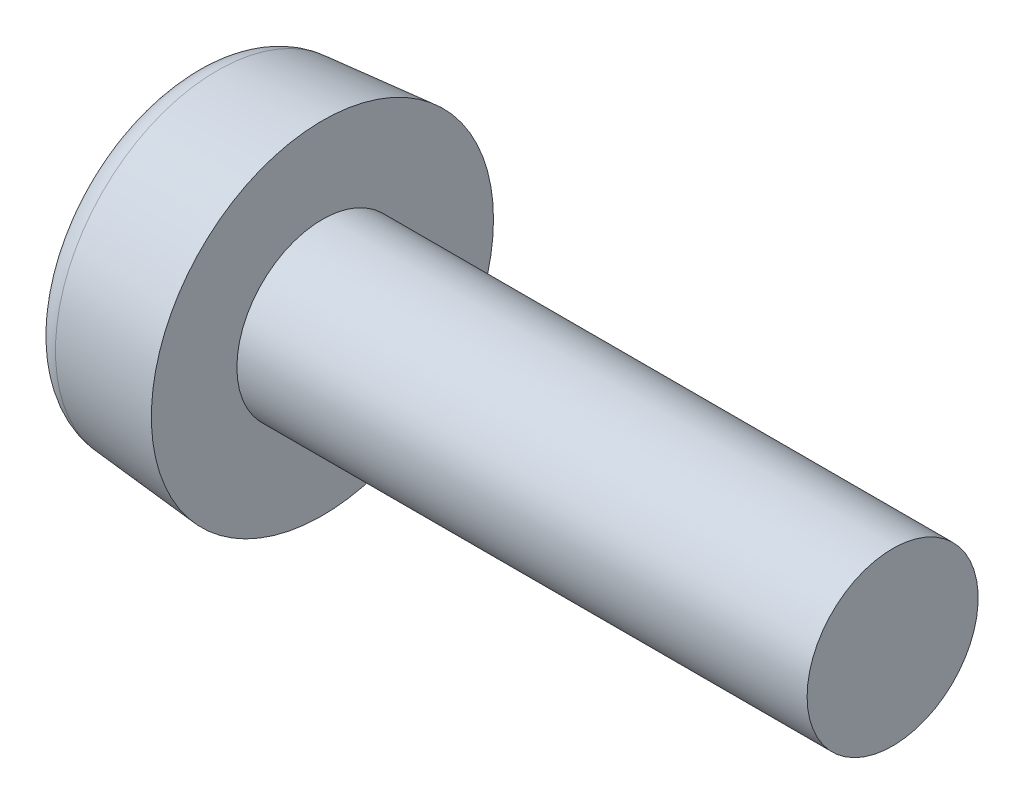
from build123d import *

# Parameters (mm, degrees)
SKETCH1_R      = 6
BASEHEAD_DEPTH = 4.6
BASEHEAD_DRAFT = -5
SKETCH8_W      = 20
SKETCH8_H      = 3
SOCKET_DEPTH   = 2
HEADFILLET2_R  = 1


with BuildPart() as part:
    # Sketch1 → BaseHead (with draft: the straight prism first)
    with BuildSketch(Plane(origin=(4.6, 0, 0), x_dir=(0, 0, -1), z_dir=(1, 0, 0))):
        Circle(SKETCH1_R)
    extrude(amount=-BASEHEAD_DEPTH)
    # BaseHead: the draft: its side faces are tilted about the plane it starts from
    basehead_sides = [part.faces().sort_by_distance(p)[0] for p in [
        (2.3, 0, 6),
    ]]
    draft(basehead_sides, Plane(origin=(4.6, 0, 0), x_dir=(0, 0, -1), z_dir=(1, 0, 0)), BASEHEAD_DRAFT)

    # Sketch8 → Revolve1 (revolve)
    with BuildSketch(Plane.XY, mode=Mode.PRIVATE) as revolve1_sk:
        with Locations((14.6, 1.5)):
            Rectangle(SKETCH8_W, SKETCH8_H)
    revolve(revolve1_sk.sketch.rotate(Axis((0, 0, 0), (1, 0, 0)), 90), axis=Axis((0, 0, 0), (1, 0, 0)))

    # Sketch4 → Socket (cut)
    with BuildSketch(Plane(origin=(0, 0, 0), x_dir=(0, 0, -1), z_dir=(1, 0, 0))):
        with BuildLine():
            add(Edge.make_bspline(
                [(1, 1.732050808), (1.384615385, 1.509993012), (2.307692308, 1.332346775), (1.846153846, 0), (2.307692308, -1.332346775), (0.923076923, -1.59881613), (0, -2.66469355), (-0.923076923, -1.59881613), (-2.307692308, -1.332346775), (-1.846153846, 0), (-2.307692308, 1.332346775), (-0.923076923, 1.59881613), (0, 2.66469355), (0.615384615, 1.954108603), (1, 1.732050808)],
                knots=[0, 0, 0, 0, 0.083333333, 0.166666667, 0.25, 0.333333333, 0.416666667, 0.5, 0.583333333, 0.666666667, 0.75, 0.833333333, 0.916666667, 1, 1, 1, 1], degree=3))
        make_face()
    extrude(amount=SOCKET_DEPTH, mode=Mode.SUBTRACT)

    # Sketch5 → Cut-Loft1 section 0
    with BuildSketch(Plane.ZY.offset(-2), mode=Mode.PRIVATE) as cut_loft1_s0:
        with BuildLine():
            add(Edge.make_bspline(
                [(-1, 1.732050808), (-1.384615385, 1.509993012), (-2.307692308, 1.332346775), (-1.846153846, 0), (-2.307692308, -1.332346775), (-0.923076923, -1.59881613), (0, -2.66469355), (0.923076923, -1.59881613), (2.307692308, -1.332346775), (1.846153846, 0), (2.307692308, 1.332346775), (0.923076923, 1.59881613), (0, 2.66469355), (-0.615384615, 1.954108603), (-1, 1.732050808)],
                knots=[0, 0, 0, 0, 0.083333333, 0.166666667, 0.25, 0.333333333, 0.416666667, 0.5, 0.583333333, 0.666666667, 0.75, 0.833333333, 0.916666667, 1, 1, 1, 1], degree=3))
        make_face()
    loft([Vertex(2.666666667, 0, 0), cut_loft1_s0.sketch], mode=Mode.SUBTRACT)

    # HeadFillet2
    headfillet2_edges = [part.edges().sort_by_distance(p)[0] for p in [
        (0, 0, 5.597552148),
    ]]
    fillet(headfillet2_edges, radius=HEADFILLET2_R)


solid = part.part
